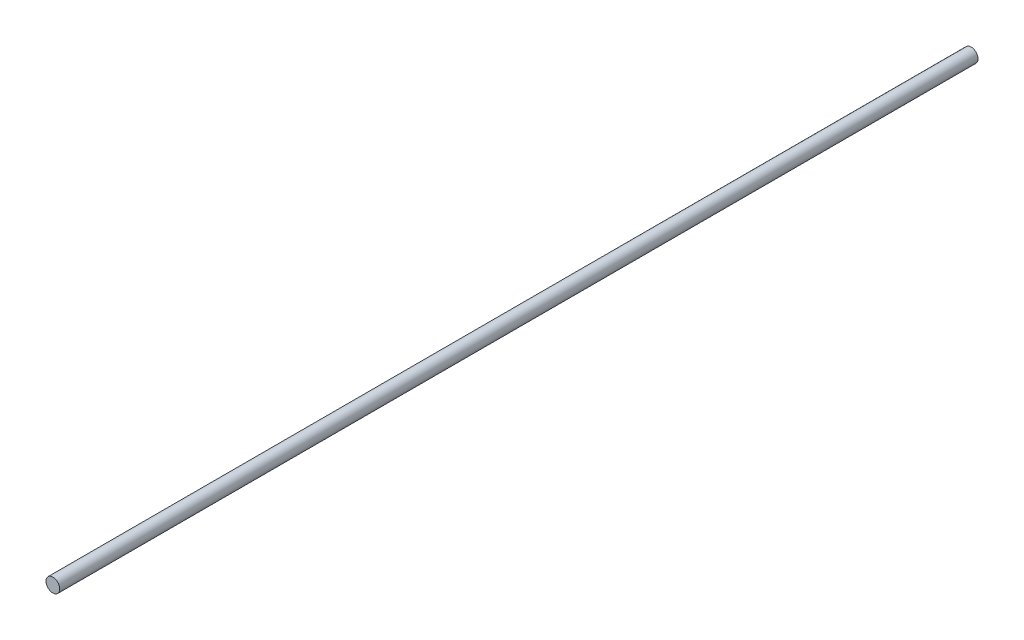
from build123d import *

# Parameters (mm, degrees)
SKETCH1_R           = 30
BOSS_EXTRUDE1_DEPTH = 4000


with BuildPart() as part:
    # Sketch1 → Boss-Extrude1 (new body)
    with BuildSketch(Plane.XY):
        Circle(SKETCH1_R)
    extrude(amount=-BOSS_EXTRUDE1_DEPTH)


solid = part.part
